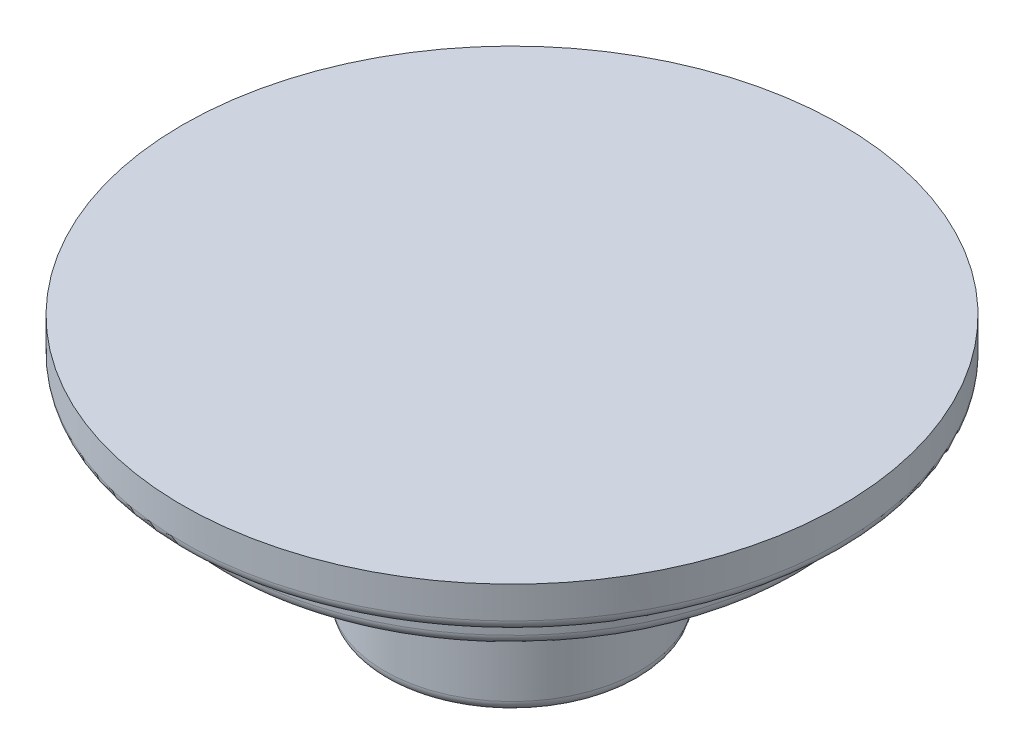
from build123d import *

# Parameters (mm, degrees)
FILLET1_R = 1.5875


with BuildPart() as part:
    # Sketch1 → Revolve1 (revolve)
    with BuildSketch(Plane.XY):
        Polygon((0, -36.5125), (-49.2125, -36.5125), (-49.2125, -42.8625), (-42.8625, -42.8625), (-42.8625, -49.2125), (-19.05, -49.2125), (-19.05, -74.6125), (-12.7, -74.6125), (-12.7, -52.3875), (0, -52.3875), align=None)
    revolve(axis=Axis((0, 0, 0), (0, -1, 0)))

    # Fillet1
    fillet1_edges = [part.edges().sort_by_distance(p)[0] for p in [
        (12.7, -52.3875, 0),
        (12.7, -74.6125, 0),
        (19.05, -74.6125, 0),
        (19.05, -49.2125, 0),
        (42.8625, -49.2125, 0),
        (42.8625, -42.8625, 0),
        (49.2125, -42.8625, 0),
    ]]
    fillet(fillet1_edges, radius=FILLET1_R)


solid = part.part
